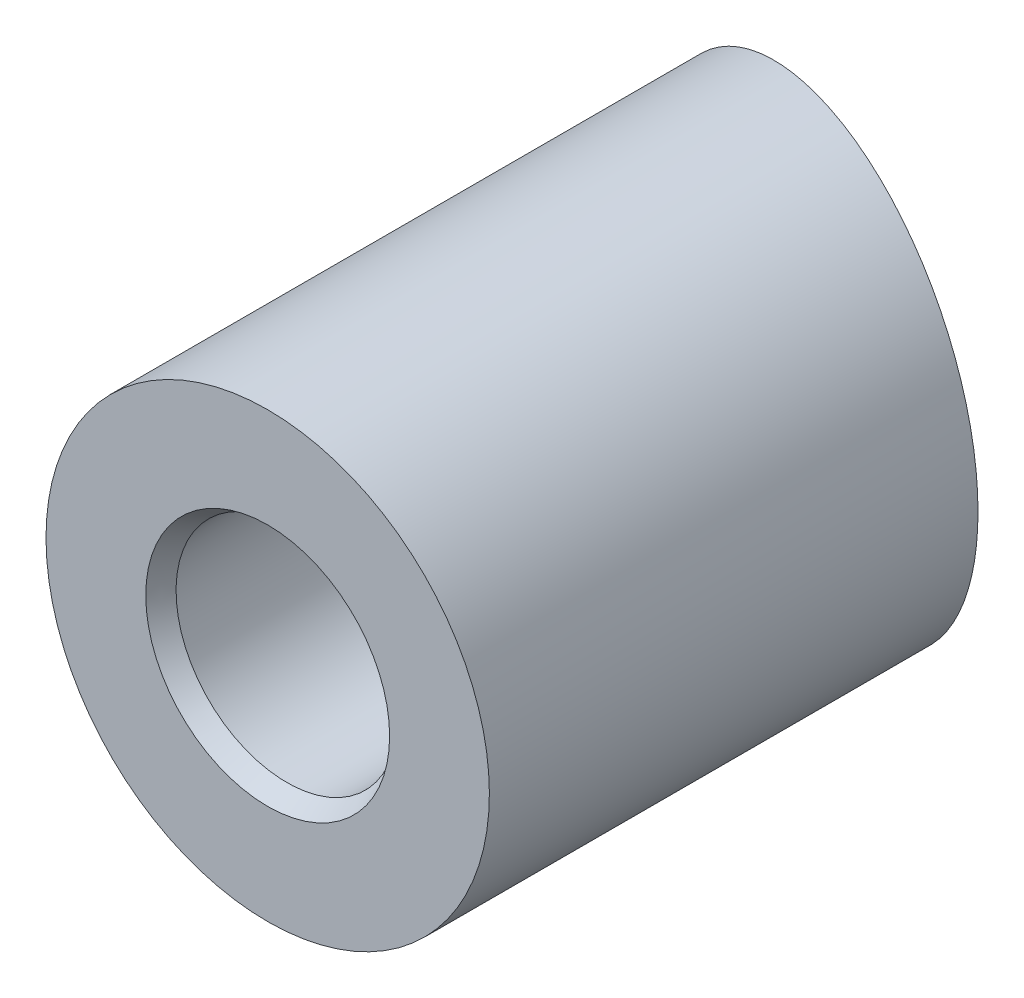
ISO-10303-21;
HEADER;
FILE_DESCRIPTION(('STEP AP214'),'2;1');
FILE_NAME('part.step','',(''),(''),'','','');
FILE_SCHEMA(('AUTOMOTIVE_DESIGN { 1 0 10303 214 1 1 1 1 }'));
ENDSEC;
DATA;
#1=APPLICATION_CONTEXT('core data for automotive mechanical design processes');
#2=APPLICATION_PROTOCOL_DEFINITION('international standard','automotive_design',2000,#1);
#3=PRODUCT_CONTEXT('',#1,'mechanical');
#4=PRODUCT('Part','Part','',(#3));
#5=PRODUCT_RELATED_PRODUCT_CATEGORY('part','',(#4));
#6=PRODUCT_DEFINITION_FORMATION('','',#4);
#7=PRODUCT_DEFINITION_CONTEXT('part definition',#1,'design');
#8=PRODUCT_DEFINITION('design','',#6,#7);
#9=PRODUCT_DEFINITION_SHAPE('','',#8);
#10=(LENGTH_UNIT() NAMED_UNIT(*) SI_UNIT(.MILLI.,.METRE.));
#11=(NAMED_UNIT(*) PLANE_ANGLE_UNIT() SI_UNIT($,.RADIAN.));
#12=(NAMED_UNIT(*) SI_UNIT($,.STERADIAN.) SOLID_ANGLE_UNIT());
#13=UNCERTAINTY_MEASURE_WITH_UNIT(LENGTH_MEASURE(1.E-05),#10,'distance_accuracy_value','');
#14=(GEOMETRIC_REPRESENTATION_CONTEXT(3) GLOBAL_UNCERTAINTY_ASSIGNED_CONTEXT((#13)) GLOBAL_UNIT_ASSIGNED_CONTEXT((#10,
#11,#12)) REPRESENTATION_CONTEXT('',''));
#15=CARTESIAN_POINT('',(0.,0.,0.));
#16=DIRECTION('',(0.,0.,1.));
#17=DIRECTION('',(1.,0.,0.));
#18=AXIS2_PLACEMENT_3D('',#15,#16,#17);
#19=CARTESIAN_POINT('',(0.,0.,0.));
#20=DIRECTION('',(0.,0.,-1.));
#21=DIRECTION('',(0.,-1.,0.));
#22=AXIS2_PLACEMENT_3D('',#19,#20,#21);
#23=CYLINDRICAL_SURFACE('',#22,10.);
#24=CARTESIAN_POINT('',(0.,0.,0.));
#25=DIRECTION('',(0.,0.,1.));
#26=DIRECTION('',(0.,1.,0.));
#27=AXIS2_PLACEMENT_3D('',#24,#25,#26);
#28=CIRCLE('',#27,10.);
#29=CARTESIAN_POINT('',(0.,10.,0.));
#30=VERTEX_POINT('',#29);
#31=EDGE_CURVE('E48',#30,#30,#28,.T.);
#32=ORIENTED_EDGE('',*,*,#31,.F.);
#33=EDGE_LOOP('',(#32));
#34=FACE_BOUND('',#33,.T.);
#35=CARTESIAN_POINT('',(0.,0.,-24.7194919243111));
#36=DIRECTION('',(-0.258819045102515,0.,0.96592582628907));
#37=DIRECTION('',(-0.96592582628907,0.,-0.258819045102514));
#38=AXIS2_PLACEMENT_3D('',#35,#36,#37);
#39=ELLIPSE('',#38,10.3527618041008,10.);
#40=CARTESIAN_POINT('',(-7.54509643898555,-6.56288958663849,-26.7411944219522));
#41=VERTEX_POINT('',#40);
#42=CARTESIAN_POINT('',(-7.54509643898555,6.56288958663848,-26.7411944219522));
#43=VERTEX_POINT('',#42);
#44=EDGE_CURVE('E39',#41,#43,#39,.T.);
#45=ORIENTED_EDGE('',*,*,#44,.T.);
#46=CARTESIAN_POINT('',(0.,0.,-31.0973578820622));
#47=DIRECTION('',(0.5,0.,0.866025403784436));
#48=DIRECTION('',(0.866025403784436,0.,-0.5));
#49=AXIS2_PLACEMENT_3D('',#46,#47,#48);
#50=ELLIPSE('',#49,11.5470053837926,10.);
#51=CARTESIAN_POINT('',(-8.76984131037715,4.8051933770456,-26.0340876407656));
#52=VERTEX_POINT('',#51);
#53=EDGE_CURVE('E21',#43,#52,#50,.T.);
#54=ORIENTED_EDGE('',*,*,#53,.T.);
#55=CARTESIAN_POINT('',(0.,0.,-58.7635809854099));
#56=DIRECTION('',(0.965925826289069,0.,0.258819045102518));
#57=DIRECTION('',(0.258819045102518,0.,-0.965925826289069));
#58=AXIS2_PLACEMENT_3D('',#55,#56,#57);
#59=ELLIPSE('',#58,38.6370330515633,10.);
#60=CARTESIAN_POINT('',(-8.7698413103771,-4.80519337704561,-26.0340876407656));
#61=VERTEX_POINT('',#60);
#62=EDGE_CURVE('E40',#52,#61,#59,.T.);
#63=ORIENTED_EDGE('',*,*,#62,.T.);
#64=CARTESIAN_POINT('',(0.,0.,-31.0973578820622));
#65=DIRECTION('',(0.5,0.,0.866025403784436));
#66=DIRECTION('',(0.866025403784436,0.,-0.5));
#67=AXIS2_PLACEMENT_3D('',#64,#65,#66);
#68=ELLIPSE('',#67,11.5470053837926,10.);
#69=EDGE_CURVE('E37',#61,#41,#68,.T.);
#70=ORIENTED_EDGE('',*,*,#69,.T.);
#71=EDGE_LOOP('',(#45,#54,#63,#70));
#72=FACE_BOUND('',#71,.T.);
#73=ADVANCED_FACE('F14',(#34,#72),#23,.T.);
#74=CARTESIAN_POINT('',(0.,0.,0.));
#75=DIRECTION('',(0.,0.,1.));
#76=DIRECTION('',(0.,1.,0.));
#77=AXIS2_PLACEMENT_3D('',#74,#75,#76);
#78=PLANE('',#77);
#79=CARTESIAN_POINT('',(0.,0.,0.));
#80=DIRECTION('',(0.,0.,1.));
#81=DIRECTION('',(0.,1.,0.));
#82=AXIS2_PLACEMENT_3D('',#79,#80,#81);
#83=CIRCLE('',#82,5.5);
#84=CARTESIAN_POINT('',(0.,5.5,0.));
#85=VERTEX_POINT('',#84);
#86=EDGE_CURVE('E56',#85,#85,#83,.T.);
#87=ORIENTED_EDGE('',*,*,#86,.F.);
#88=EDGE_LOOP('',(#87));
#89=FACE_BOUND('',#88,.T.);
#90=ORIENTED_EDGE('',*,*,#31,.T.);
#91=EDGE_LOOP('',(#90));
#92=FACE_BOUND('',#91,.T.);
#93=ADVANCED_FACE('F81',(#89,#92),#78,.T.);
#94=CARTESIAN_POINT('',(10.,-5.25,-22.04));
#95=DIRECTION('',(-0.258819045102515,0.,0.96592582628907));
#96=DIRECTION('',(0.96592582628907,0.,0.258819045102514));
#97=AXIS2_PLACEMENT_3D('',#94,#95,#96);
#98=PLANE('',#97);
#99=ORIENTED_EDGE('',*,*,#44,.F.);
#100=DIRECTION('',(0.,1.,0.));
#101=VECTOR('',#100,1.);
#102=CARTESIAN_POINT('',(-7.54509643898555,-5.25,-26.7411944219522));
#103=LINE('',#102,#101);
#104=EDGE_CURVE('E43',#41,#43,#103,.T.);
#105=ORIENTED_EDGE('',*,*,#104,.T.);
#106=EDGE_LOOP('',(#99,#105));
#107=FACE_BOUND('',#106,.T.);
#108=ADVANCED_FACE('F47',(#107),#98,.F.);
#109=CARTESIAN_POINT('',(-8.51102226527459,-10.,-27.0000134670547));
#110=DIRECTION('',(0.965925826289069,0.,0.258819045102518));
#111=DIRECTION('',(0.258819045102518,0.,-0.965925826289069));
#112=AXIS2_PLACEMENT_3D('',#109,#110,#111);
#113=PLANE('',#112);
#114=ORIENTED_EDGE('',*,*,#62,.F.);
#115=DIRECTION('',(0.,-1.,0.));
#116=VECTOR('',#115,1.);
#117=CARTESIAN_POINT('',(-8.76984131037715,-10.,-26.0340876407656));
#118=LINE('',#117,#116);
#119=EDGE_CURVE('E9',#52,#61,#118,.T.);
#120=ORIENTED_EDGE('',*,*,#119,.T.);
#121=EDGE_LOOP('',(#114,#120));
#122=FACE_BOUND('',#121,.T.);
#123=ADVANCED_FACE('F77',(#122),#113,.F.);
#124=CARTESIAN_POINT('',(0.,0.,0.));
#125=DIRECTION('',(0.,0.,1.));
#126=DIRECTION('',(0.,1.,0.));
#127=AXIS2_PLACEMENT_3D('',#124,#125,#126);
#128=CONICAL_SURFACE('',#127,5.5,0.523598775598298);
#129=CARTESIAN_POINT('',(0.,0.,-0.866025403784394));
#130=DIRECTION('',(0.,0.,1.));
#131=DIRECTION('',(0.,1.,0.));
#132=AXIS2_PLACEMENT_3D('',#129,#130,#131);
#133=CIRCLE('',#132,5.);
#134=CARTESIAN_POINT('',(0.,5.,-0.866025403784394));
#135=VERTEX_POINT('',#134);
#136=EDGE_CURVE('E59',#135,#135,#133,.T.);
#137=ORIENTED_EDGE('',*,*,#136,.F.);
#138=EDGE_LOOP('',(#137));
#139=FACE_BOUND('',#138,.T.);
#140=ORIENTED_EDGE('',*,*,#86,.T.);
#141=EDGE_LOOP('',(#140));
#142=FACE_BOUND('',#141,.T.);
#143=ADVANCED_FACE('F71',(#139,#142),#128,.F.);
#144=CARTESIAN_POINT('',(0.,0.,0.));
#145=DIRECTION('',(0.,0.,1.));
#146=DIRECTION('',(0.,1.,0.));
#147=AXIS2_PLACEMENT_3D('',#144,#145,#146);
#148=CYLINDRICAL_SURFACE('',#147,5.);
#149=CARTESIAN_POINT('',(0.,0.,-15.));
#150=DIRECTION('',(0.,0.,1.));
#151=DIRECTION('',(1.,0.,0.));
#152=AXIS2_PLACEMENT_3D('',#149,#150,#151);
#153=CIRCLE('',#152,5.);
#154=CARTESIAN_POINT('',(5.,0.,-15.));
#155=VERTEX_POINT('',#154);
#156=EDGE_CURVE('E62',#155,#155,#153,.T.);
#157=ORIENTED_EDGE('',*,*,#156,.F.);
#158=EDGE_LOOP('',(#157));
#159=FACE_BOUND('',#158,.T.);
#160=ORIENTED_EDGE('',*,*,#136,.T.);
#161=EDGE_LOOP('',(#160));
#162=FACE_BOUND('',#161,.T.);
#163=ADVANCED_FACE('F68',(#159,#162),#148,.F.);
#164=CARTESIAN_POINT('',(-7.54509643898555,-5.25,-26.7411944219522));
#165=DIRECTION('',(0.5,0.,0.866025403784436));
#166=DIRECTION('',(0.866025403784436,0.,-0.5));
#167=AXIS2_PLACEMENT_3D('',#164,#165,#166);
#168=PLANE('',#167);
#169=ORIENTED_EDGE('',*,*,#69,.F.);
#170=ORIENTED_EDGE('',*,*,#119,.F.);
#171=ORIENTED_EDGE('',*,*,#53,.F.);
#172=ORIENTED_EDGE('',*,*,#104,.F.);
#173=EDGE_LOOP('',(#169,#170,#171,#172));
#174=FACE_BOUND('',#173,.T.);
#175=ADVANCED_FACE('F50',(#174),#168,.F.);
#176=CARTESIAN_POINT('',(0.,0.,-15.));
#177=DIRECTION('',(0.,0.,1.));
#178=DIRECTION('',(1.,0.,0.));
#179=AXIS2_PLACEMENT_3D('',#176,#177,#178);
#180=PLANE('',#179);
#181=ORIENTED_EDGE('',*,*,#156,.T.);
#182=EDGE_LOOP('',(#181));
#183=FACE_BOUND('',#182,.T.);
#184=ADVANCED_FACE('F66',(#183),#180,.T.);
#185=CLOSED_SHELL('',(#73,#93,#108,#123,#143,#163,#175,#184));
#186=MANIFOLD_SOLID_BREP('B1',#185);
#187=ADVANCED_BREP_SHAPE_REPRESENTATION('',(#18,#186),#14);
#188=SHAPE_DEFINITION_REPRESENTATION(#9,#187);
ENDSEC;
END-ISO-10303-21;
